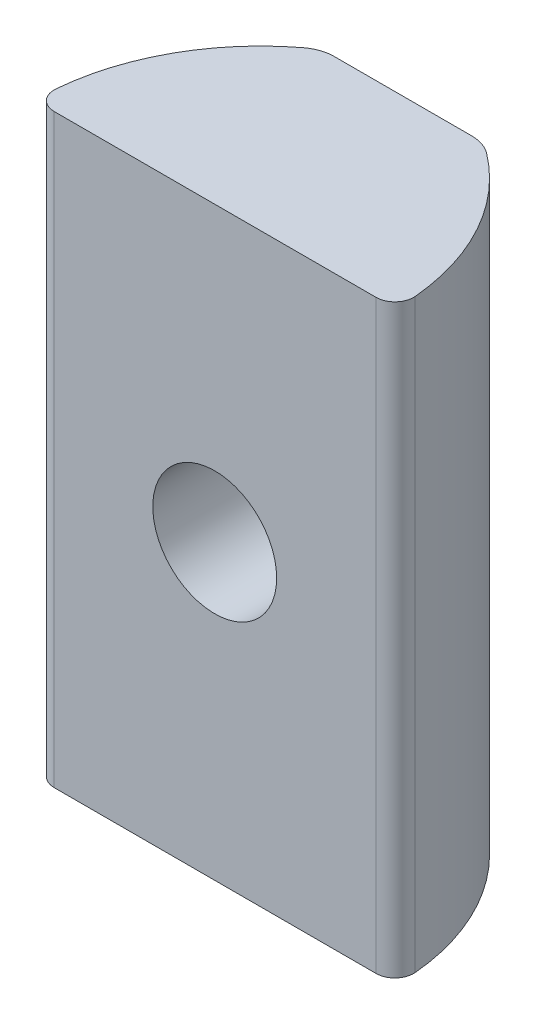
from build123d import *

# Parameters (mm, degrees)
EXTRUDE_1_DEPTH = 7.8
M4X0_7_1_D      = 3.3


with BuildPart() as part:
    # Sketch 1 → Extrude 1 (new, symmetric)
    with BuildSketch(Plane.XZ):
        with BuildLine():
            Line((-4.28842123, 0), (4.28842123, 0))
            ThreePointArc((4.28842123, 0), (4.657211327, -0.162370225), (4.786479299, -0.54402454))
            ThreePointArc((4.786479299, -0.54402454), (4.060490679, -2.919187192), (2.434814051, -4.796853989))
            ThreePointArc((2.434814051, -4.796853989), (2.149347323, -4.947853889), (1.830642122, -5))
            Line((1.830642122, -5), (-1.830642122, -5))
            ThreePointArc((-1.830642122, -5), (-2.149347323, -4.947853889), (-2.434814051, -4.796853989))
            ThreePointArc((-2.434814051, -4.796853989), (-4.060490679, -2.919187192), (-4.786479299, -0.54402454))
            ThreePointArc((-4.786479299, -0.54402454), (-4.657211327, -0.162370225), (-4.28842123, 0))
        make_face()
    extrude(amount=EXTRUDE_1_DEPTH, both=True)

    # M4x0.7 _1 (through all)
    with Locations(Plane(origin=(1.337388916, 5.214464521, 0), x_dir=(1, 0, 0), z_dir=(0, 0, 1))):
        with Locations((-1.348967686, -5.214464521)):
            Hole(M4X0_7_1_D / 2)


solid = part.part
